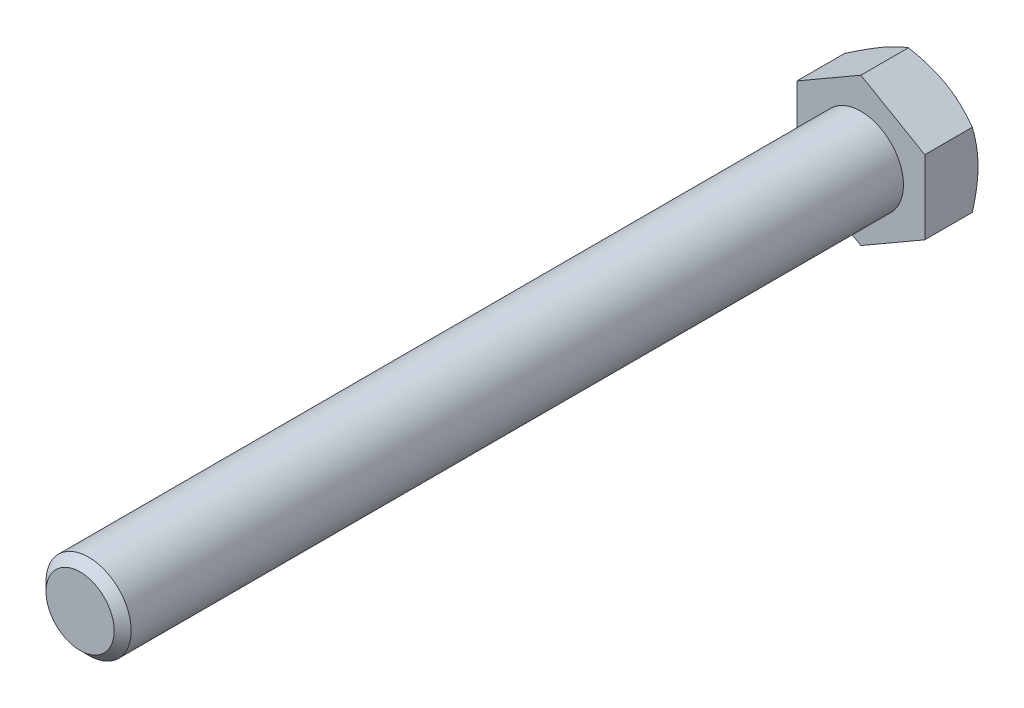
from build123d import *

# Parameters (mm, degrees)
ESQUISSE1_W        = 6
ESQUISSE1_H        = 110
CHANFREIN1_SIZE    = 1.2
BOSS_EXTRU_1_DEPTH = 7.5


with BuildPart() as part:
    # Esquisse1 → Base-R_volution (revolve)
    with BuildSketch(Plane(origin=(0, 0, 0), x_dir=(1, 0, 0), z_dir=(0, 1, 0))):
        with Locations((3, -55)):
            Rectangle(ESQUISSE1_W, ESQUISSE1_H)
    revolve(axis=Axis((0, 0, 0), (0, 0, 1)))

    # Chanfrein1
    chanfrein1_edges = [part.edges().sort_by_distance(p)[0] for p in [
        (-6, 0, 110),
    ]]
    chamfer(chanfrein1_edges, length=CHANFREIN1_SIZE)

    # Esquisse6 → Boss.-Extru.1 (add)
    with BuildSketch(Plane.XY):
        Polygon((9, -5.196152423), (9, 5.196152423), (0, 10.392304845), (-9, 5.196152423), (-9, -5.196152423), (0, -10.392304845), align=None)
    extrude(amount=-BOSS_EXTRU_1_DEPTH)

    # Esquisse7 → Enl_vement de mati_re-R_volution1 (revolve, cut)
    with BuildSketch(Plane(origin=(0, 0, 0), x_dir=(1, 0, 0), z_dir=(0, 1, 0))):
        Polygon((-9, 7.5), (-21.990381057, 7.5), (-21.990381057, 0), align=None)
    revolve(axis=Axis((0, 0, -6.239446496), (0, 0, 1)), mode=Mode.SUBTRACT)


solid = part.part
